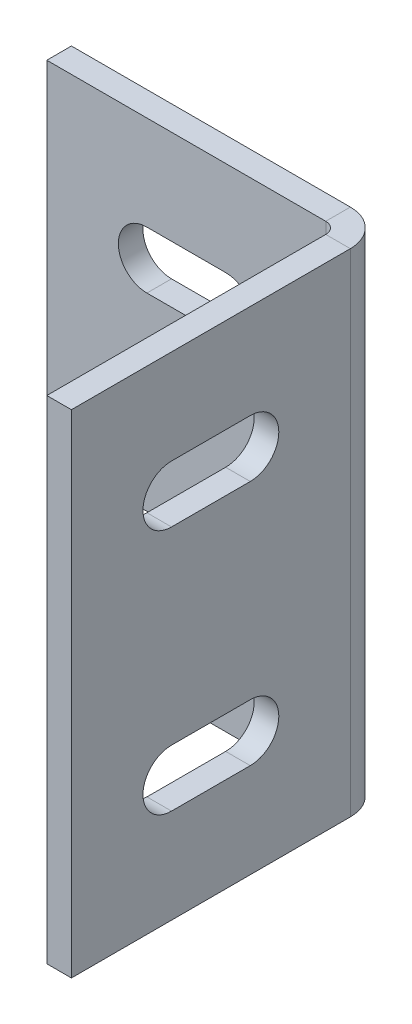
ISO-10303-21;
HEADER;
FILE_DESCRIPTION(('STEP AP214'),'2;1');
FILE_NAME('part.step','',(''),(''),'','','');
FILE_SCHEMA(('AUTOMOTIVE_DESIGN { 1 0 10303 214 1 1 1 1 }'));
ENDSEC;
DATA;
#1=APPLICATION_CONTEXT('core data for automotive mechanical design processes');
#2=APPLICATION_PROTOCOL_DEFINITION('international standard','automotive_design',2000,#1);
#3=PRODUCT_CONTEXT('',#1,'mechanical');
#4=PRODUCT('Part','Part','',(#3));
#5=PRODUCT_RELATED_PRODUCT_CATEGORY('part','',(#4));
#6=PRODUCT_DEFINITION_FORMATION('','',#4);
#7=PRODUCT_DEFINITION_CONTEXT('part definition',#1,'design');
#8=PRODUCT_DEFINITION('design','',#6,#7);
#9=PRODUCT_DEFINITION_SHAPE('','',#8);
#10=(LENGTH_UNIT() NAMED_UNIT(*) SI_UNIT(.MILLI.,.METRE.));
#11=(NAMED_UNIT(*) PLANE_ANGLE_UNIT() SI_UNIT($,.RADIAN.));
#12=(NAMED_UNIT(*) SI_UNIT($,.STERADIAN.) SOLID_ANGLE_UNIT());
#13=UNCERTAINTY_MEASURE_WITH_UNIT(LENGTH_MEASURE(1.E-05),#10,'distance_accuracy_value','');
#14=(GEOMETRIC_REPRESENTATION_CONTEXT(3) GLOBAL_UNCERTAINTY_ASSIGNED_CONTEXT((#13)) GLOBAL_UNIT_ASSIGNED_CONTEXT((#10,
#11,#12)) REPRESENTATION_CONTEXT('',''));
#15=CARTESIAN_POINT('',(0.,0.,0.));
#16=DIRECTION('',(0.,0.,1.));
#17=DIRECTION('',(1.,0.,0.));
#18=AXIS2_PLACEMENT_3D('',#15,#16,#17);
#19=CARTESIAN_POINT('',(-10.16,15.875,-1.5875));
#20=DIRECTION('',(0.,1.,0.));
#21=DIRECTION('',(0.,0.,1.));
#22=AXIS2_PLACEMENT_3D('',#19,#20,#21);
#23=PLANE('',#22);
#24=DIRECTION('',(-1.,0.,0.));
#25=VECTOR('',#24,1.);
#26=CARTESIAN_POINT('',(-10.16,15.875,0.));
#27=LINE('',#26,#25);
#28=CARTESIAN_POINT('',(7.8359,15.875,0.));
#29=VERTEX_POINT('',#28);
#30=CARTESIAN_POINT('',(-10.16,15.875,0.));
#31=VERTEX_POINT('',#30);
#32=EDGE_CURVE('E379',#29,#31,#27,.T.);
#33=ORIENTED_EDGE('',*,*,#32,.F.);
#34=DIRECTION('',(0.,0.,-1.));
#35=VECTOR('',#34,1.);
#36=CARTESIAN_POINT('',(7.8359,15.875,0.));
#37=LINE('',#36,#35);
#38=CARTESIAN_POINT('',(7.8359,15.875,-1.5875));
#39=VERTEX_POINT('',#38);
#40=EDGE_CURVE('E366',#29,#39,#37,.T.);
#41=ORIENTED_EDGE('',*,*,#40,.T.);
#42=DIRECTION('',(-1.,0.,0.));
#43=VECTOR('',#42,1.);
#44=CARTESIAN_POINT('',(-10.16,15.875,-1.5875));
#45=LINE('',#44,#43);
#46=CARTESIAN_POINT('',(-10.16,15.875,-1.5875));
#47=VERTEX_POINT('',#46);
#48=EDGE_CURVE('E382',#39,#47,#45,.T.);
#49=ORIENTED_EDGE('',*,*,#48,.T.);
#50=DIRECTION('',(0.,0.,1.));
#51=VECTOR('',#50,1.);
#52=CARTESIAN_POINT('',(-10.16,15.875,-1.5875));
#53=LINE('',#52,#51);
#54=EDGE_CURVE('E391',#47,#31,#53,.T.);
#55=ORIENTED_EDGE('',*,*,#54,.T.);
#56=EDGE_LOOP('',(#33,#41,#49,#55));
#57=FACE_BOUND('',#56,.T.);
#58=ADVANCED_FACE('F60',(#57),#23,.T.);
#59=CARTESIAN_POINT('',(0.,0.,-1.5875));
#60=DIRECTION('',(0.,0.,-1.));
#61=DIRECTION('',(-1.,0.,0.));
#62=AXIS2_PLACEMENT_3D('',#59,#60,#61);
#63=PLANE('',#62);
#64=CARTESIAN_POINT('',(-3.70205,7.9375,-1.5875));
#65=DIRECTION('',(0.,0.,-1.));
#66=DIRECTION('',(-1.,0.,0.));
#67=AXIS2_PLACEMENT_3D('',#64,#65,#66);
#68=CIRCLE('',#67,1.8415);
#69=CARTESIAN_POINT('',(-3.70205,6.096,-1.5875));
#70=VERTEX_POINT('',#69);
#71=CARTESIAN_POINT('',(-3.70205,9.779,-1.5875));
#72=VERTEX_POINT('',#71);
#73=EDGE_CURVE('E326',#70,#72,#68,.T.);
#74=ORIENTED_EDGE('',*,*,#73,.F.);
#75=DIRECTION('',(-1.,0.,0.));
#76=VECTOR('',#75,1.);
#77=CARTESIAN_POINT('',(0.,6.096,-1.5875));
#78=LINE('',#77,#76);
#79=CARTESIAN_POINT('',(1.37795,6.096,-1.5875));
#80=VERTEX_POINT('',#79);
#81=EDGE_CURVE('E319',#80,#70,#78,.T.);
#82=ORIENTED_EDGE('',*,*,#81,.F.);
#83=CARTESIAN_POINT('',(1.37795,7.9375,-1.5875));
#84=DIRECTION('',(0.,0.,-1.));
#85=DIRECTION('',(-1.,0.,0.));
#86=AXIS2_PLACEMENT_3D('',#83,#84,#85);
#87=CIRCLE('',#86,1.8415);
#88=CARTESIAN_POINT('',(1.37795,9.779,-1.5875));
#89=VERTEX_POINT('',#88);
#90=EDGE_CURVE('E321',#89,#80,#87,.T.);
#91=ORIENTED_EDGE('',*,*,#90,.F.);
#92=DIRECTION('',(1.,0.,0.));
#93=VECTOR('',#92,1.);
#94=CARTESIAN_POINT('',(0.,9.779,-1.5875));
#95=LINE('',#94,#93);
#96=EDGE_CURVE('E324',#72,#89,#95,.T.);
#97=ORIENTED_EDGE('',*,*,#96,.F.);
#98=EDGE_LOOP('',(#74,#82,#91,#97));
#99=FACE_BOUND('',#98,.T.);
#100=CARTESIAN_POINT('',(-3.70205,-7.9375,-1.5875));
#101=DIRECTION('',(0.,0.,-1.));
#102=DIRECTION('',(-1.,0.,0.));
#103=AXIS2_PLACEMENT_3D('',#100,#101,#102);
#104=CIRCLE('',#103,1.8415);
#105=CARTESIAN_POINT('',(-3.70205,-9.779,-1.5875));
#106=VERTEX_POINT('',#105);
#107=CARTESIAN_POINT('',(-3.70205,-6.096,-1.5875));
#108=VERTEX_POINT('',#107);
#109=EDGE_CURVE('E317',#106,#108,#104,.T.);
#110=ORIENTED_EDGE('',*,*,#109,.F.);
#111=DIRECTION('',(-1.,0.,0.));
#112=VECTOR('',#111,1.);
#113=CARTESIAN_POINT('',(0.,-9.779,-1.5875));
#114=LINE('',#113,#112);
#115=CARTESIAN_POINT('',(1.37795000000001,-9.779,-1.5875));
#116=VERTEX_POINT('',#115);
#117=EDGE_CURVE('E286',#116,#106,#114,.T.);
#118=ORIENTED_EDGE('',*,*,#117,.F.);
#119=CARTESIAN_POINT('',(1.37795,-7.9375,-1.5875));
#120=DIRECTION('',(0.,0.,-1.));
#121=DIRECTION('',(-1.,0.,0.));
#122=AXIS2_PLACEMENT_3D('',#119,#120,#121);
#123=CIRCLE('',#122,1.8415);
#124=CARTESIAN_POINT('',(1.37795,-6.096,-1.5875));
#125=VERTEX_POINT('',#124);
#126=EDGE_CURVE('E312',#125,#116,#123,.T.);
#127=ORIENTED_EDGE('',*,*,#126,.F.);
#128=DIRECTION('',(1.,0.,0.));
#129=VECTOR('',#128,1.);
#130=CARTESIAN_POINT('',(0.,-6.096,-1.5875));
#131=LINE('',#130,#129);
#132=EDGE_CURVE('E315',#108,#125,#131,.T.);
#133=ORIENTED_EDGE('',*,*,#132,.F.);
#134=EDGE_LOOP('',(#110,#118,#127,#133));
#135=FACE_BOUND('',#134,.T.);
#136=ORIENTED_EDGE('',*,*,#48,.F.);
#137=DIRECTION('',(0.,1.,0.));
#138=VECTOR('',#137,1.);
#139=CARTESIAN_POINT('',(7.8359,15.875,-1.5875));
#140=LINE('',#139,#138);
#141=CARTESIAN_POINT('',(7.8359,-15.875,-1.5875));
#142=VERTEX_POINT('',#141);
#143=EDGE_CURVE('E359',#39,#142,#140,.F.);
#144=ORIENTED_EDGE('',*,*,#143,.T.);
#145=DIRECTION('',(1.,0.,0.));
#146=VECTOR('',#145,1.);
#147=CARTESIAN_POINT('',(-10.16,-15.875,-1.5875));
#148=LINE('',#147,#146);
#149=CARTESIAN_POINT('',(-10.16,-15.875,-1.5875));
#150=VERTEX_POINT('',#149);
#151=EDGE_CURVE('E388',#150,#142,#148,.T.);
#152=ORIENTED_EDGE('',*,*,#151,.F.);
#153=DIRECTION('',(0.,-1.,0.));
#154=VECTOR('',#153,1.);
#155=CARTESIAN_POINT('',(-10.16,-15.875,-1.5875));
#156=LINE('',#155,#154);
#157=EDGE_CURVE('E384',#47,#150,#156,.T.);
#158=ORIENTED_EDGE('',*,*,#157,.F.);
#159=EDGE_LOOP('',(#136,#144,#152,#158));
#160=FACE_BOUND('',#159,.T.);
#161=ADVANCED_FACE('F436',(#99,#135,#160),#63,.T.);
#162=CARTESIAN_POINT('',(0.,0.,0.));
#163=DIRECTION('',(0.,0.,-1.));
#164=DIRECTION('',(-1.,0.,0.));
#165=AXIS2_PLACEMENT_3D('',#162,#163,#164);
#166=PLANE('',#165);
#167=DIRECTION('',(1.,0.,0.));
#168=VECTOR('',#167,1.);
#169=CARTESIAN_POINT('',(-3.70205,6.096,0.));
#170=LINE('',#169,#168);
#171=CARTESIAN_POINT('',(-3.70205,6.096,0.));
#172=VERTEX_POINT('',#171);
#173=CARTESIAN_POINT('',(1.37795,6.096,0.));
#174=VERTEX_POINT('',#173);
#175=EDGE_CURVE('E273',#172,#174,#170,.T.);
#176=ORIENTED_EDGE('',*,*,#175,.F.);
#177=CARTESIAN_POINT('',(-3.70205,7.9375,0.));
#178=DIRECTION('',(0.,0.,1.));
#179=DIRECTION('',(1.,0.,0.));
#180=AXIS2_PLACEMENT_3D('',#177,#178,#179);
#181=CIRCLE('',#180,1.8415);
#182=CARTESIAN_POINT('',(-3.70205,9.779,0.));
#183=VERTEX_POINT('',#182);
#184=EDGE_CURVE('E271',#183,#172,#181,.T.);
#185=ORIENTED_EDGE('',*,*,#184,.F.);
#186=DIRECTION('',(-1.,0.,0.));
#187=VECTOR('',#186,1.);
#188=CARTESIAN_POINT('',(-3.70205,9.779,0.));
#189=LINE('',#188,#187);
#190=CARTESIAN_POINT('',(1.37795,9.779,0.));
#191=VERTEX_POINT('',#190);
#192=EDGE_CURVE('E280',#191,#183,#189,.T.);
#193=ORIENTED_EDGE('',*,*,#192,.F.);
#194=CARTESIAN_POINT('',(1.37795,7.9375,0.));
#195=DIRECTION('',(0.,0.,1.));
#196=DIRECTION('',(1.,0.,0.));
#197=AXIS2_PLACEMENT_3D('',#194,#195,#196);
#198=CIRCLE('',#197,1.8415);
#199=EDGE_CURVE('E277',#174,#191,#198,.T.);
#200=ORIENTED_EDGE('',*,*,#199,.F.);
#201=EDGE_LOOP('',(#176,#185,#193,#200));
#202=FACE_BOUND('',#201,.T.);
#203=DIRECTION('',(1.,0.,0.));
#204=VECTOR('',#203,1.);
#205=CARTESIAN_POINT('',(-3.70205,-9.779,0.));
#206=LINE('',#205,#204);
#207=CARTESIAN_POINT('',(-3.70205,-9.779,0.));
#208=VERTEX_POINT('',#207);
#209=CARTESIAN_POINT('',(1.37795000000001,-9.779,0.));
#210=VERTEX_POINT('',#209);
#211=EDGE_CURVE('E294',#208,#210,#206,.T.);
#212=ORIENTED_EDGE('',*,*,#211,.F.);
#213=CARTESIAN_POINT('',(-3.70205,-7.9375,0.));
#214=DIRECTION('',(0.,0.,1.));
#215=DIRECTION('',(-1.,0.,0.));
#216=AXIS2_PLACEMENT_3D('',#213,#214,#215);
#217=CIRCLE('',#216,1.8415);
#218=CARTESIAN_POINT('',(-3.70205,-6.096,0.));
#219=VERTEX_POINT('',#218);
#220=EDGE_CURVE('E250',#219,#208,#217,.T.);
#221=ORIENTED_EDGE('',*,*,#220,.F.);
#222=DIRECTION('',(-1.,0.,0.));
#223=VECTOR('',#222,1.);
#224=CARTESIAN_POINT('',(-3.70205,-6.096,0.));
#225=LINE('',#224,#223);
#226=CARTESIAN_POINT('',(1.37795,-6.096,0.));
#227=VERTEX_POINT('',#226);
#228=EDGE_CURVE('E300',#227,#219,#225,.T.);
#229=ORIENTED_EDGE('',*,*,#228,.F.);
#230=CARTESIAN_POINT('',(1.37795,-7.9375,0.));
#231=DIRECTION('',(0.,0.,1.));
#232=DIRECTION('',(-1.,0.,0.));
#233=AXIS2_PLACEMENT_3D('',#230,#231,#232);
#234=CIRCLE('',#233,1.8415);
#235=EDGE_CURVE('E297',#210,#227,#234,.T.);
#236=ORIENTED_EDGE('',*,*,#235,.F.);
#237=EDGE_LOOP('',(#212,#221,#229,#236));
#238=FACE_BOUND('',#237,.T.);
#239=DIRECTION('',(0.,1.,0.));
#240=VECTOR('',#239,1.);
#241=CARTESIAN_POINT('',(7.8359,15.875,0.));
#242=LINE('',#241,#240);
#243=CARTESIAN_POINT('',(7.8359,-15.875,0.));
#244=VERTEX_POINT('',#243);
#245=EDGE_CURVE('E372',#29,#244,#242,.F.);
#246=ORIENTED_EDGE('',*,*,#245,.F.);
#247=ORIENTED_EDGE('',*,*,#32,.T.);
#248=DIRECTION('',(0.,-1.,0.));
#249=VECTOR('',#248,1.);
#250=CARTESIAN_POINT('',(-10.16,-15.875,0.));
#251=LINE('',#250,#249);
#252=CARTESIAN_POINT('',(-10.16,-15.875,0.));
#253=VERTEX_POINT('',#252);
#254=EDGE_CURVE('E393',#31,#253,#251,.T.);
#255=ORIENTED_EDGE('',*,*,#254,.T.);
#256=DIRECTION('',(1.,0.,0.));
#257=VECTOR('',#256,1.);
#258=CARTESIAN_POINT('',(-10.16,-15.875,0.));
#259=LINE('',#258,#257);
#260=EDGE_CURVE('E385',#253,#244,#259,.T.);
#261=ORIENTED_EDGE('',*,*,#260,.T.);
#262=EDGE_LOOP('',(#246,#247,#255,#261));
#263=FACE_BOUND('',#262,.T.);
#264=ADVANCED_FACE('F441',(#202,#238,#263),#166,.F.);
#265=CARTESIAN_POINT('',(-10.16,-15.875,-1.5875));
#266=DIRECTION('',(0.,-1.,0.));
#267=DIRECTION('',(0.,0.,-1.));
#268=AXIS2_PLACEMENT_3D('',#265,#266,#267);
#269=PLANE('',#268);
#270=DIRECTION('',(0.,0.,-1.));
#271=VECTOR('',#270,1.);
#272=CARTESIAN_POINT('',(7.8359,-15.875,0.));
#273=LINE('',#272,#271);
#274=EDGE_CURVE('E376',#244,#142,#273,.T.);
#275=ORIENTED_EDGE('',*,*,#274,.F.);
#276=ORIENTED_EDGE('',*,*,#260,.F.);
#277=DIRECTION('',(0.,0.,1.));
#278=VECTOR('',#277,1.);
#279=CARTESIAN_POINT('',(-10.16,-15.875,-1.5875));
#280=LINE('',#279,#278);
#281=EDGE_CURVE('E398',#150,#253,#280,.T.);
#282=ORIENTED_EDGE('',*,*,#281,.F.);
#283=ORIENTED_EDGE('',*,*,#151,.T.);
#284=EDGE_LOOP('',(#275,#276,#282,#283));
#285=FACE_BOUND('',#284,.T.);
#286=ADVANCED_FACE('F500',(#285),#269,.T.);
#287=CARTESIAN_POINT('',(-10.16,-15.875,-1.5875));
#288=DIRECTION('',(-1.,0.,0.));
#289=DIRECTION('',(0.,0.,1.));
#290=AXIS2_PLACEMENT_3D('',#287,#288,#289);
#291=PLANE('',#290);
#292=ORIENTED_EDGE('',*,*,#254,.F.);
#293=ORIENTED_EDGE('',*,*,#54,.F.);
#294=ORIENTED_EDGE('',*,*,#157,.T.);
#295=ORIENTED_EDGE('',*,*,#281,.T.);
#296=EDGE_LOOP('',(#292,#293,#294,#295));
#297=FACE_BOUND('',#296,.T.);
#298=ADVANCED_FACE('F495',(#297),#291,.T.);
#299=CARTESIAN_POINT('',(7.8359,-15.875,0.736599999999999));
#300=DIRECTION('',(0.,-1.,0.));
#301=DIRECTION('',(0.,0.,-1.));
#302=AXIS2_PLACEMENT_3D('',#299,#300,#301);
#303=PLANE('',#302);
#304=DIRECTION('',(-1.,0.,0.));
#305=VECTOR('',#304,1.);
#306=CARTESIAN_POINT('',(10.16,-15.875,0.736599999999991));
#307=LINE('',#306,#305);
#308=CARTESIAN_POINT('',(8.5725,-15.875,0.736599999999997));
#309=VERTEX_POINT('',#308);
#310=CARTESIAN_POINT('',(10.16,-15.875,0.736599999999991));
#311=VERTEX_POINT('',#310);
#312=EDGE_CURVE('E328',#309,#311,#307,.F.);
#313=ORIENTED_EDGE('',*,*,#312,.F.);
#314=CARTESIAN_POINT('',(7.8359,-15.875,0.736599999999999));
#315=DIRECTION('',(0.,1.,0.));
#316=DIRECTION('',(0.,0.,1.));
#317=AXIS2_PLACEMENT_3D('',#314,#315,#316);
#318=CIRCLE('',#317,0.7366);
#319=EDGE_CURVE('E369',#244,#309,#318,.F.);
#320=ORIENTED_EDGE('',*,*,#319,.F.);
#321=ORIENTED_EDGE('',*,*,#274,.T.);
#322=CARTESIAN_POINT('',(7.8359,-15.875,0.736599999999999));
#323=DIRECTION('',(0.,1.,0.));
#324=DIRECTION('',(0.,0.,1.));
#325=AXIS2_PLACEMENT_3D('',#322,#323,#324);
#326=CIRCLE('',#325,2.3241);
#327=EDGE_CURVE('E362',#142,#311,#326,.F.);
#328=ORIENTED_EDGE('',*,*,#327,.T.);
#329=EDGE_LOOP('',(#313,#320,#321,#328));
#330=FACE_BOUND('',#329,.T.);
#331=ADVANCED_FACE('F458',(#330),#303,.T.);
#332=CARTESIAN_POINT('',(7.8359,15.875,0.736600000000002));
#333=DIRECTION('',(0.,-1.,0.));
#334=DIRECTION('',(0.,0.,-1.));
#335=AXIS2_PLACEMENT_3D('',#332,#333,#334);
#336=PLANE('',#335);
#337=CARTESIAN_POINT('',(7.8359,15.875,0.736600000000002));
#338=DIRECTION('',(0.,1.,0.));
#339=DIRECTION('',(0.,0.,1.));
#340=AXIS2_PLACEMENT_3D('',#337,#338,#339);
#341=CIRCLE('',#340,0.7366);
#342=CARTESIAN_POINT('',(8.5725,15.875,0.736599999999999));
#343=VERTEX_POINT('',#342);
#344=EDGE_CURVE('E332',#343,#29,#341,.T.);
#345=ORIENTED_EDGE('',*,*,#344,.F.);
#346=DIRECTION('',(-1.,0.,0.));
#347=VECTOR('',#346,1.);
#348=CARTESIAN_POINT('',(8.5725,15.875,0.736599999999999));
#349=LINE('',#348,#347);
#350=CARTESIAN_POINT('',(10.16,15.875,0.736599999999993));
#351=VERTEX_POINT('',#350);
#352=EDGE_CURVE('E352',#343,#351,#349,.F.);
#353=ORIENTED_EDGE('',*,*,#352,.T.);
#354=CARTESIAN_POINT('',(7.8359,15.875,0.736600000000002));
#355=DIRECTION('',(0.,1.,0.));
#356=DIRECTION('',(0.,0.,1.));
#357=AXIS2_PLACEMENT_3D('',#354,#355,#356);
#358=CIRCLE('',#357,2.3241);
#359=EDGE_CURVE('E363',#351,#39,#358,.T.);
#360=ORIENTED_EDGE('',*,*,#359,.T.);
#361=ORIENTED_EDGE('',*,*,#40,.F.);
#362=EDGE_LOOP('',(#345,#353,#360,#361));
#363=FACE_BOUND('',#362,.T.);
#364=ADVANCED_FACE('F476',(#363),#336,.F.);
#365=CARTESIAN_POINT('',(7.8359,15.875,0.736600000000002));
#366=DIRECTION('',(0.,1.,0.));
#367=DIRECTION('',(1.,0.,0.));
#368=AXIS2_PLACEMENT_3D('',#365,#366,#367);
#369=CYLINDRICAL_SURFACE('',#368,2.3241);
#370=ORIENTED_EDGE('',*,*,#143,.F.);
#371=ORIENTED_EDGE('',*,*,#359,.F.);
#372=DIRECTION('',(0.,1.,0.));
#373=VECTOR('',#372,1.);
#374=CARTESIAN_POINT('',(10.16,-15.875,0.736599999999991));
#375=LINE('',#374,#373);
#376=EDGE_CURVE('E350',#351,#311,#375,.F.);
#377=ORIENTED_EDGE('',*,*,#376,.T.);
#378=ORIENTED_EDGE('',*,*,#327,.F.);
#379=EDGE_LOOP('',(#370,#371,#377,#378));
#380=FACE_BOUND('',#379,.T.);
#381=ADVANCED_FACE('F486',(#380),#369,.T.);
#382=CARTESIAN_POINT('',(7.8359,15.875,0.736600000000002));
#383=DIRECTION('',(0.,1.,0.));
#384=DIRECTION('',(1.,0.,0.));
#385=AXIS2_PLACEMENT_3D('',#382,#383,#384);
#386=CYLINDRICAL_SURFACE('',#385,0.7366);
#387=ORIENTED_EDGE('',*,*,#245,.T.);
#388=ORIENTED_EDGE('',*,*,#319,.T.);
#389=DIRECTION('',(0.,1.,0.));
#390=VECTOR('',#389,1.);
#391=CARTESIAN_POINT('',(8.5725,-15.875,0.736599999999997));
#392=LINE('',#391,#390);
#393=EDGE_CURVE('E355',#309,#343,#392,.T.);
#394=ORIENTED_EDGE('',*,*,#393,.T.);
#395=ORIENTED_EDGE('',*,*,#344,.T.);
#396=EDGE_LOOP('',(#387,#388,#394,#395));
#397=FACE_BOUND('',#396,.T.);
#398=ADVANCED_FACE('F454',(#397),#386,.F.);
#399=CARTESIAN_POINT('',(10.1600000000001,15.875,18.7325));
#400=DIRECTION('',(0.,-1.,0.));
#401=DIRECTION('',(0.,0.,-1.));
#402=AXIS2_PLACEMENT_3D('',#399,#400,#401);
#403=PLANE('',#402);
#404=ORIENTED_EDGE('',*,*,#352,.F.);
#405=DIRECTION('',(0.,0.,-1.));
#406=VECTOR('',#405,1.);
#407=CARTESIAN_POINT('',(8.57250000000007,15.875,18.7325));
#408=LINE('',#407,#406);
#409=CARTESIAN_POINT('',(8.57250000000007,15.875,18.7325));
#410=VERTEX_POINT('',#409);
#411=EDGE_CURVE('E348',#343,#410,#408,.F.);
#412=ORIENTED_EDGE('',*,*,#411,.T.);
#413=DIRECTION('',(-1.,0.,0.));
#414=VECTOR('',#413,1.);
#415=CARTESIAN_POINT('',(10.1600000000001,15.875,18.7325));
#416=LINE('',#415,#414);
#417=CARTESIAN_POINT('',(10.1600000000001,15.875,18.7325));
#418=VERTEX_POINT('',#417);
#419=EDGE_CURVE('E329',#418,#410,#416,.T.);
#420=ORIENTED_EDGE('',*,*,#419,.F.);
#421=DIRECTION('',(0.,0.,1.));
#422=VECTOR('',#421,1.);
#423=CARTESIAN_POINT('',(10.16,15.875,0.));
#424=LINE('',#423,#422);
#425=EDGE_CURVE('E341',#351,#418,#424,.T.);
#426=ORIENTED_EDGE('',*,*,#425,.F.);
#427=EDGE_LOOP('',(#404,#412,#420,#426));
#428=FACE_BOUND('',#427,.T.);
#429=ADVANCED_FACE('F478',(#428),#403,.F.);
#430=CARTESIAN_POINT('',(10.16,-15.875,0.));
#431=DIRECTION('',(0.,1.,0.));
#432=DIRECTION('',(0.,0.,1.));
#433=AXIS2_PLACEMENT_3D('',#430,#431,#432);
#434=PLANE('',#433);
#435=ORIENTED_EDGE('',*,*,#312,.T.);
#436=DIRECTION('',(0.,0.,-1.));
#437=VECTOR('',#436,1.);
#438=CARTESIAN_POINT('',(10.16,-15.875,0.));
#439=LINE('',#438,#437);
#440=CARTESIAN_POINT('',(10.1600000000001,-15.875,18.7325));
#441=VERTEX_POINT('',#440);
#442=EDGE_CURVE('E336',#441,#311,#439,.T.);
#443=ORIENTED_EDGE('',*,*,#442,.F.);
#444=DIRECTION('',(-1.,0.,0.));
#445=VECTOR('',#444,1.);
#446=CARTESIAN_POINT('',(10.1600000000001,-15.875,18.7325));
#447=LINE('',#446,#445);
#448=CARTESIAN_POINT('',(8.57250000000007,-15.875,18.7325));
#449=VERTEX_POINT('',#448);
#450=EDGE_CURVE('E333',#441,#449,#447,.T.);
#451=ORIENTED_EDGE('',*,*,#450,.T.);
#452=DIRECTION('',(0.,0.,1.));
#453=VECTOR('',#452,1.);
#454=CARTESIAN_POINT('',(8.5725,-15.875,0.));
#455=LINE('',#454,#453);
#456=EDGE_CURVE('E343',#449,#309,#455,.F.);
#457=ORIENTED_EDGE('',*,*,#456,.T.);
#458=EDGE_LOOP('',(#435,#443,#451,#457));
#459=FACE_BOUND('',#458,.T.);
#460=ADVANCED_FACE('F461',(#459),#434,.F.);
#461=CARTESIAN_POINT('',(10.16,0.,0.));
#462=DIRECTION('',(-1.,0.,0.));
#463=DIRECTION('',(0.,0.,1.));
#464=AXIS2_PLACEMENT_3D('',#461,#462,#463);
#465=PLANE('',#464);
#466=DIRECTION('',(0.,0.,-1.));
#467=VECTOR('',#466,1.);
#468=CARTESIAN_POINT('',(10.16,6.096,12.27455));
#469=LINE('',#468,#467);
#470=CARTESIAN_POINT('',(10.16,6.096,12.2745500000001));
#471=VERTEX_POINT('',#470);
#472=CARTESIAN_POINT('',(10.16,6.096,7.19455));
#473=VERTEX_POINT('',#472);
#474=EDGE_CURVE('E236',#471,#473,#469,.T.);
#475=ORIENTED_EDGE('',*,*,#474,.F.);
#476=CARTESIAN_POINT('',(10.16,7.9375,12.27455));
#477=DIRECTION('',(1.,0.,0.));
#478=DIRECTION('',(0.,0.,-1.));
#479=AXIS2_PLACEMENT_3D('',#476,#477,#478);
#480=CIRCLE('',#479,1.8415);
#481=CARTESIAN_POINT('',(10.16,9.779,12.27455));
#482=VERTEX_POINT('',#481);
#483=EDGE_CURVE('E74',#482,#471,#480,.T.);
#484=ORIENTED_EDGE('',*,*,#483,.F.);
#485=DIRECTION('',(0.,0.,1.));
#486=VECTOR('',#485,1.);
#487=CARTESIAN_POINT('',(10.16,9.779,12.27455));
#488=LINE('',#487,#486);
#489=CARTESIAN_POINT('',(10.16,9.779,7.19455));
#490=VERTEX_POINT('',#489);
#491=EDGE_CURVE('E243',#490,#482,#488,.T.);
#492=ORIENTED_EDGE('',*,*,#491,.F.);
#493=CARTESIAN_POINT('',(10.16,7.9375,7.19455));
#494=DIRECTION('',(1.,0.,0.));
#495=DIRECTION('',(0.,0.,-1.));
#496=AXIS2_PLACEMENT_3D('',#493,#494,#495);
#497=CIRCLE('',#496,1.8415);
#498=EDGE_CURVE('E226',#473,#490,#497,.T.);
#499=ORIENTED_EDGE('',*,*,#498,.F.);
#500=EDGE_LOOP('',(#475,#484,#492,#499));
#501=FACE_BOUND('',#500,.T.);
#502=DIRECTION('',(0.,0.,-1.));
#503=VECTOR('',#502,1.);
#504=CARTESIAN_POINT('',(10.16,-9.779,12.27455));
#505=LINE('',#504,#503);
#506=CARTESIAN_POINT('',(10.16,-9.779,12.2745500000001));
#507=VERTEX_POINT('',#506);
#508=CARTESIAN_POINT('',(10.16,-9.779,7.19455));
#509=VERTEX_POINT('',#508);
#510=EDGE_CURVE('E254',#507,#509,#505,.T.);
#511=ORIENTED_EDGE('',*,*,#510,.F.);
#512=CARTESIAN_POINT('',(10.16,-7.9375,12.27455));
#513=DIRECTION('',(1.,0.,0.));
#514=DIRECTION('',(0.,0.,1.));
#515=AXIS2_PLACEMENT_3D('',#512,#513,#514);
#516=CIRCLE('',#515,1.8415);
#517=CARTESIAN_POINT('',(10.16,-6.096,12.27455));
#518=VERTEX_POINT('',#517);
#519=EDGE_CURVE('E82',#518,#507,#516,.T.);
#520=ORIENTED_EDGE('',*,*,#519,.F.);
#521=DIRECTION('',(0.,0.,1.));
#522=VECTOR('',#521,1.);
#523=CARTESIAN_POINT('',(10.16,-6.096,12.27455));
#524=LINE('',#523,#522);
#525=CARTESIAN_POINT('',(10.16,-6.096,7.19455));
#526=VERTEX_POINT('',#525);
#527=EDGE_CURVE('E260',#526,#518,#524,.T.);
#528=ORIENTED_EDGE('',*,*,#527,.F.);
#529=CARTESIAN_POINT('',(10.16,-7.9375,7.19455));
#530=DIRECTION('',(1.,0.,0.));
#531=DIRECTION('',(0.,0.,1.));
#532=AXIS2_PLACEMENT_3D('',#529,#530,#531);
#533=CIRCLE('',#532,1.8415);
#534=EDGE_CURVE('E257',#509,#526,#533,.T.);
#535=ORIENTED_EDGE('',*,*,#534,.F.);
#536=EDGE_LOOP('',(#511,#520,#528,#535));
#537=FACE_BOUND('',#536,.T.);
#538=ORIENTED_EDGE('',*,*,#376,.F.);
#539=ORIENTED_EDGE('',*,*,#425,.T.);
#540=DIRECTION('',(0.,-1.,0.));
#541=VECTOR('',#540,1.);
#542=CARTESIAN_POINT('',(10.1600000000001,0.,18.7325));
#543=LINE('',#542,#541);
#544=EDGE_CURVE('E339',#418,#441,#543,.T.);
#545=ORIENTED_EDGE('',*,*,#544,.T.);
#546=ORIENTED_EDGE('',*,*,#442,.T.);
#547=EDGE_LOOP('',(#538,#539,#545,#546));
#548=FACE_BOUND('',#547,.T.);
#549=ADVANCED_FACE('F240',(#501,#537,#548),#465,.F.);
#550=CARTESIAN_POINT('',(8.5725,0.,0.));
#551=DIRECTION('',(-1.,0.,0.));
#552=DIRECTION('',(0.,0.,1.));
#553=AXIS2_PLACEMENT_3D('',#550,#551,#552);
#554=PLANE('',#553);
#555=CARTESIAN_POINT('',(8.57250000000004,7.9375,12.27455));
#556=DIRECTION('',(-1.,0.,0.));
#557=DIRECTION('',(0.,0.,1.));
#558=AXIS2_PLACEMENT_3D('',#555,#556,#557);
#559=CIRCLE('',#558,1.8415);
#560=CARTESIAN_POINT('',(8.57250000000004,6.096,12.27455));
#561=VERTEX_POINT('',#560);
#562=CARTESIAN_POINT('',(8.57250000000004,9.779,12.27455));
#563=VERTEX_POINT('',#562);
#564=EDGE_CURVE('E13',#561,#563,#559,.T.);
#565=ORIENTED_EDGE('',*,*,#564,.F.);
#566=DIRECTION('',(0.,0.,1.));
#567=VECTOR('',#566,1.);
#568=CARTESIAN_POINT('',(8.5725,6.096,0.));
#569=LINE('',#568,#567);
#570=CARTESIAN_POINT('',(8.57250000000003,6.096,7.19455));
#571=VERTEX_POINT('',#570);
#572=EDGE_CURVE('E411',#571,#561,#569,.T.);
#573=ORIENTED_EDGE('',*,*,#572,.F.);
#574=CARTESIAN_POINT('',(8.57250000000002,7.9375,7.19455));
#575=DIRECTION('',(-1.,0.,0.));
#576=DIRECTION('',(0.,0.,1.));
#577=AXIS2_PLACEMENT_3D('',#574,#575,#576);
#578=CIRCLE('',#577,1.8415);
#579=CARTESIAN_POINT('',(8.57250000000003,9.779,7.19455));
#580=VERTEX_POINT('',#579);
#581=EDGE_CURVE('E229',#580,#571,#578,.T.);
#582=ORIENTED_EDGE('',*,*,#581,.F.);
#583=DIRECTION('',(0.,0.,-1.));
#584=VECTOR('',#583,1.);
#585=CARTESIAN_POINT('',(8.5725,9.77900000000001,0.));
#586=LINE('',#585,#584);
#587=EDGE_CURVE('E67',#563,#580,#586,.T.);
#588=ORIENTED_EDGE('',*,*,#587,.F.);
#589=EDGE_LOOP('',(#565,#573,#582,#588));
#590=FACE_BOUND('',#589,.T.);
#591=CARTESIAN_POINT('',(8.57250000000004,-7.9375,12.27455));
#592=DIRECTION('',(-1.,0.,0.));
#593=DIRECTION('',(0.,0.,1.));
#594=AXIS2_PLACEMENT_3D('',#591,#592,#593);
#595=CIRCLE('',#594,1.8415);
#596=CARTESIAN_POINT('',(8.57250000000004,-9.779,12.27455));
#597=VERTEX_POINT('',#596);
#598=CARTESIAN_POINT('',(8.57250000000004,-6.096,12.27455));
#599=VERTEX_POINT('',#598);
#600=EDGE_CURVE('E409',#597,#599,#595,.T.);
#601=ORIENTED_EDGE('',*,*,#600,.F.);
#602=DIRECTION('',(0.,0.,1.));
#603=VECTOR('',#602,1.);
#604=CARTESIAN_POINT('',(8.5725,-9.779,0.));
#605=LINE('',#604,#603);
#606=CARTESIAN_POINT('',(8.57250000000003,-9.779,7.19455));
#607=VERTEX_POINT('',#606);
#608=EDGE_CURVE('E400',#607,#597,#605,.T.);
#609=ORIENTED_EDGE('',*,*,#608,.F.);
#610=CARTESIAN_POINT('',(8.57250000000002,-7.9375,7.19455));
#611=DIRECTION('',(-1.,0.,0.));
#612=DIRECTION('',(0.,0.,1.));
#613=AXIS2_PLACEMENT_3D('',#610,#611,#612);
#614=CIRCLE('',#613,1.8415);
#615=CARTESIAN_POINT('',(8.57250000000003,-6.096,7.19455));
#616=VERTEX_POINT('',#615);
#617=EDGE_CURVE('E404',#616,#607,#614,.T.);
#618=ORIENTED_EDGE('',*,*,#617,.F.);
#619=DIRECTION('',(0.,0.,-1.));
#620=VECTOR('',#619,1.);
#621=CARTESIAN_POINT('',(8.5725,-6.096,0.));
#622=LINE('',#621,#620);
#623=EDGE_CURVE('E407',#599,#616,#622,.T.);
#624=ORIENTED_EDGE('',*,*,#623,.F.);
#625=EDGE_LOOP('',(#601,#609,#618,#624));
#626=FACE_BOUND('',#625,.T.);
#627=ORIENTED_EDGE('',*,*,#411,.F.);
#628=ORIENTED_EDGE('',*,*,#393,.F.);
#629=ORIENTED_EDGE('',*,*,#456,.F.);
#630=DIRECTION('',(0.,1.,0.));
#631=VECTOR('',#630,1.);
#632=CARTESIAN_POINT('',(8.57250000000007,-15.875,18.7325));
#633=LINE('',#632,#631);
#634=EDGE_CURVE('E346',#410,#449,#633,.F.);
#635=ORIENTED_EDGE('',*,*,#634,.F.);
#636=EDGE_LOOP('',(#627,#628,#629,#635));
#637=FACE_BOUND('',#636,.T.);
#638=ADVANCED_FACE('F419',(#590,#626,#637),#554,.T.);
#639=CARTESIAN_POINT('',(10.1600000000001,-15.875,18.7325));
#640=DIRECTION('',(0.,0.,-1.));
#641=DIRECTION('',(-1.,0.,0.));
#642=AXIS2_PLACEMENT_3D('',#639,#640,#641);
#643=PLANE('',#642);
#644=ORIENTED_EDGE('',*,*,#634,.T.);
#645=ORIENTED_EDGE('',*,*,#450,.F.);
#646=ORIENTED_EDGE('',*,*,#544,.F.);
#647=ORIENTED_EDGE('',*,*,#419,.T.);
#648=EDGE_LOOP('',(#644,#645,#646,#647));
#649=FACE_BOUND('',#648,.T.);
#650=ADVANCED_FACE('F470',(#649),#643,.F.);
#651=CARTESIAN_POINT('',(-3.70205,-7.9375,-2.54));
#652=DIRECTION('',(0.,0.,1.));
#653=DIRECTION('',(1.,0.,0.));
#654=AXIS2_PLACEMENT_3D('',#651,#652,#653);
#655=CYLINDRICAL_SURFACE('',#654,1.8415);
#656=ORIENTED_EDGE('',*,*,#109,.T.);
#657=DIRECTION('',(0.,0.,1.));
#658=VECTOR('',#657,1.);
#659=CARTESIAN_POINT('',(-3.70205,-6.096,-2.54));
#660=LINE('',#659,#658);
#661=EDGE_CURVE('E274',#108,#219,#660,.T.);
#662=ORIENTED_EDGE('',*,*,#661,.T.);
#663=ORIENTED_EDGE('',*,*,#220,.T.);
#664=DIRECTION('',(0.,0.,1.));
#665=VECTOR('',#664,1.);
#666=CARTESIAN_POINT('',(-3.70205,-9.779,-2.54));
#667=LINE('',#666,#665);
#668=EDGE_CURVE('E303',#106,#208,#667,.T.);
#669=ORIENTED_EDGE('',*,*,#668,.F.);
#670=EDGE_LOOP('',(#656,#662,#663,#669));
#671=FACE_BOUND('',#670,.T.);
#672=ADVANCED_FACE('F553',(#671),#655,.F.);
#673=CARTESIAN_POINT('',(-3.70205,-6.096,-2.54));
#674=DIRECTION('',(0.,1.,0.));
#675=DIRECTION('',(-1.,0.,0.));
#676=AXIS2_PLACEMENT_3D('',#673,#674,#675);
#677=PLANE('',#676);
#678=ORIENTED_EDGE('',*,*,#132,.T.);
#679=DIRECTION('',(0.,0.,1.));
#680=VECTOR('',#679,1.);
#681=CARTESIAN_POINT('',(1.37795,-6.096,-2.54));
#682=LINE('',#681,#680);
#683=EDGE_CURVE('E305',#125,#227,#682,.T.);
#684=ORIENTED_EDGE('',*,*,#683,.T.);
#685=ORIENTED_EDGE('',*,*,#228,.T.);
#686=ORIENTED_EDGE('',*,*,#661,.F.);
#687=EDGE_LOOP('',(#678,#684,#685,#686));
#688=FACE_BOUND('',#687,.T.);
#689=ADVANCED_FACE('F578',(#688),#677,.F.);
#690=CARTESIAN_POINT('',(1.37795,-7.9375,-2.54));
#691=DIRECTION('',(0.,0.,1.));
#692=DIRECTION('',(1.,0.,0.));
#693=AXIS2_PLACEMENT_3D('',#690,#691,#692);
#694=CYLINDRICAL_SURFACE('',#693,1.8415);
#695=ORIENTED_EDGE('',*,*,#126,.T.);
#696=DIRECTION('',(0.,0.,1.));
#697=VECTOR('',#696,1.);
#698=CARTESIAN_POINT('',(1.37795000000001,-9.779,-2.54));
#699=LINE('',#698,#697);
#700=EDGE_CURVE('E307',#116,#210,#699,.T.);
#701=ORIENTED_EDGE('',*,*,#700,.T.);
#702=ORIENTED_EDGE('',*,*,#235,.T.);
#703=ORIENTED_EDGE('',*,*,#683,.F.);
#704=EDGE_LOOP('',(#695,#701,#702,#703));
#705=FACE_BOUND('',#704,.T.);
#706=ADVANCED_FACE('F589',(#705),#694,.F.);
#707=CARTESIAN_POINT('',(-3.70205,-9.779,-2.54));
#708=DIRECTION('',(0.,-1.,0.));
#709=DIRECTION('',(0.,0.,-1.));
#710=AXIS2_PLACEMENT_3D('',#707,#708,#709);
#711=PLANE('',#710);
#712=ORIENTED_EDGE('',*,*,#117,.T.);
#713=ORIENTED_EDGE('',*,*,#668,.T.);
#714=ORIENTED_EDGE('',*,*,#211,.T.);
#715=ORIENTED_EDGE('',*,*,#700,.F.);
#716=EDGE_LOOP('',(#712,#713,#714,#715));
#717=FACE_BOUND('',#716,.T.);
#718=ADVANCED_FACE('F600',(#717),#711,.F.);
#719=CARTESIAN_POINT('',(-3.70205,7.9375,-2.54));
#720=DIRECTION('',(0.,0.,1.));
#721=DIRECTION('',(1.,0.,0.));
#722=AXIS2_PLACEMENT_3D('',#719,#720,#721);
#723=CYLINDRICAL_SURFACE('',#722,1.8415);
#724=ORIENTED_EDGE('',*,*,#73,.T.);
#725=DIRECTION('',(0.,0.,1.));
#726=VECTOR('',#725,1.);
#727=CARTESIAN_POINT('',(-3.70205,9.779,-2.54));
#728=LINE('',#727,#726);
#729=EDGE_CURVE('E284',#72,#183,#728,.T.);
#730=ORIENTED_EDGE('',*,*,#729,.T.);
#731=ORIENTED_EDGE('',*,*,#184,.T.);
#732=DIRECTION('',(0.,0.,1.));
#733=VECTOR('',#732,1.);
#734=CARTESIAN_POINT('',(-3.70205,6.096,-2.54));
#735=LINE('',#734,#733);
#736=EDGE_CURVE('E283',#70,#172,#735,.T.);
#737=ORIENTED_EDGE('',*,*,#736,.F.);
#738=EDGE_LOOP('',(#724,#730,#731,#737));
#739=FACE_BOUND('',#738,.T.);
#740=ADVANCED_FACE('F611',(#739),#723,.F.);
#741=CARTESIAN_POINT('',(-3.70205,9.779,-2.54));
#742=DIRECTION('',(0.,1.,0.));
#743=DIRECTION('',(0.,0.,1.));
#744=AXIS2_PLACEMENT_3D('',#741,#742,#743);
#745=PLANE('',#744);
#746=ORIENTED_EDGE('',*,*,#96,.T.);
#747=DIRECTION('',(0.,0.,1.));
#748=VECTOR('',#747,1.);
#749=CARTESIAN_POINT('',(1.37795,9.779,-2.54));
#750=LINE('',#749,#748);
#751=EDGE_CURVE('E287',#89,#191,#750,.T.);
#752=ORIENTED_EDGE('',*,*,#751,.T.);
#753=ORIENTED_EDGE('',*,*,#192,.T.);
#754=ORIENTED_EDGE('',*,*,#729,.F.);
#755=EDGE_LOOP('',(#746,#752,#753,#754));
#756=FACE_BOUND('',#755,.T.);
#757=ADVANCED_FACE('F622',(#756),#745,.F.);
#758=CARTESIAN_POINT('',(1.37795,7.9375,-2.54));
#759=DIRECTION('',(0.,0.,1.));
#760=DIRECTION('',(1.,0.,0.));
#761=AXIS2_PLACEMENT_3D('',#758,#759,#760);
#762=CYLINDRICAL_SURFACE('',#761,1.8415);
#763=ORIENTED_EDGE('',*,*,#90,.T.);
#764=DIRECTION('',(0.,0.,1.));
#765=VECTOR('',#764,1.);
#766=CARTESIAN_POINT('',(1.37795,6.096,-2.54));
#767=LINE('',#766,#765);
#768=EDGE_CURVE('E289',#80,#174,#767,.T.);
#769=ORIENTED_EDGE('',*,*,#768,.T.);
#770=ORIENTED_EDGE('',*,*,#199,.T.);
#771=ORIENTED_EDGE('',*,*,#751,.F.);
#772=EDGE_LOOP('',(#763,#769,#770,#771));
#773=FACE_BOUND('',#772,.T.);
#774=ADVANCED_FACE('F633',(#773),#762,.F.);
#775=CARTESIAN_POINT('',(-3.70205,6.096,-2.54));
#776=DIRECTION('',(0.,-1.,0.));
#777=DIRECTION('',(1.,0.,0.));
#778=AXIS2_PLACEMENT_3D('',#775,#776,#777);
#779=PLANE('',#778);
#780=ORIENTED_EDGE('',*,*,#81,.T.);
#781=ORIENTED_EDGE('',*,*,#736,.T.);
#782=ORIENTED_EDGE('',*,*,#175,.T.);
#783=ORIENTED_EDGE('',*,*,#768,.F.);
#784=EDGE_LOOP('',(#780,#781,#782,#783));
#785=FACE_BOUND('',#784,.T.);
#786=ADVANCED_FACE('F644',(#785),#779,.F.);
#787=CARTESIAN_POINT('',(-10.16,-7.9375,12.2745500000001));
#788=DIRECTION('',(1.,0.,0.));
#789=DIRECTION('',(0.,0.,-1.));
#790=AXIS2_PLACEMENT_3D('',#787,#788,#789);
#791=CYLINDRICAL_SURFACE('',#790,1.8415);
#792=ORIENTED_EDGE('',*,*,#600,.T.);
#793=DIRECTION('',(1.,0.,0.));
#794=VECTOR('',#793,1.);
#795=CARTESIAN_POINT('',(-10.16,-6.096,12.2745500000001));
#796=LINE('',#795,#794);
#797=EDGE_CURVE('E264',#599,#518,#796,.T.);
#798=ORIENTED_EDGE('',*,*,#797,.T.);
#799=ORIENTED_EDGE('',*,*,#519,.T.);
#800=DIRECTION('',(1.,0.,0.));
#801=VECTOR('',#800,1.);
#802=CARTESIAN_POINT('',(-10.16,-9.779,12.2745500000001));
#803=LINE('',#802,#801);
#804=EDGE_CURVE('E263',#597,#507,#803,.T.);
#805=ORIENTED_EDGE('',*,*,#804,.F.);
#806=EDGE_LOOP('',(#792,#798,#799,#805));
#807=FACE_BOUND('',#806,.T.);
#808=ADVANCED_FACE('F655',(#807),#791,.F.);
#809=CARTESIAN_POINT('',(-10.16,-6.096,12.2745500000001));
#810=DIRECTION('',(0.,1.,0.));
#811=DIRECTION('',(0.,0.,1.));
#812=AXIS2_PLACEMENT_3D('',#809,#810,#811);
#813=PLANE('',#812);
#814=ORIENTED_EDGE('',*,*,#623,.T.);
#815=DIRECTION('',(1.,0.,0.));
#816=VECTOR('',#815,1.);
#817=CARTESIAN_POINT('',(-10.16,-6.096,7.19455000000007));
#818=LINE('',#817,#816);
#819=EDGE_CURVE('E266',#616,#526,#818,.T.);
#820=ORIENTED_EDGE('',*,*,#819,.T.);
#821=ORIENTED_EDGE('',*,*,#527,.T.);
#822=ORIENTED_EDGE('',*,*,#797,.F.);
#823=EDGE_LOOP('',(#814,#820,#821,#822));
#824=FACE_BOUND('',#823,.T.);
#825=ADVANCED_FACE('F680',(#824),#813,.F.);
#826=CARTESIAN_POINT('',(-10.16,-7.9375,7.19455000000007));
#827=DIRECTION('',(1.,0.,0.));
#828=DIRECTION('',(0.,0.,-1.));
#829=AXIS2_PLACEMENT_3D('',#826,#827,#828);
#830=CYLINDRICAL_SURFACE('',#829,1.8415);
#831=ORIENTED_EDGE('',*,*,#617,.T.);
#832=DIRECTION('',(1.,0.,0.));
#833=VECTOR('',#832,1.);
#834=CARTESIAN_POINT('',(-10.16,-9.779,7.19455000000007));
#835=LINE('',#834,#833);
#836=EDGE_CURVE('E268',#607,#509,#835,.T.);
#837=ORIENTED_EDGE('',*,*,#836,.T.);
#838=ORIENTED_EDGE('',*,*,#534,.T.);
#839=ORIENTED_EDGE('',*,*,#819,.F.);
#840=EDGE_LOOP('',(#831,#837,#838,#839));
#841=FACE_BOUND('',#840,.T.);
#842=ADVANCED_FACE('F430',(#841),#830,.F.);
#843=CARTESIAN_POINT('',(-10.16,-9.779,12.2745500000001));
#844=DIRECTION('',(0.,-1.,0.));
#845=DIRECTION('',(0.,0.,-1.));
#846=AXIS2_PLACEMENT_3D('',#843,#844,#845);
#847=PLANE('',#846);
#848=ORIENTED_EDGE('',*,*,#608,.T.);
#849=ORIENTED_EDGE('',*,*,#804,.T.);
#850=ORIENTED_EDGE('',*,*,#510,.T.);
#851=ORIENTED_EDGE('',*,*,#836,.F.);
#852=EDGE_LOOP('',(#848,#849,#850,#851));
#853=FACE_BOUND('',#852,.T.);
#854=ADVANCED_FACE('F423',(#853),#847,.F.);
#855=CARTESIAN_POINT('',(-10.16,7.9375,12.2745500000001));
#856=DIRECTION('',(1.,0.,0.));
#857=DIRECTION('',(0.,0.,-1.));
#858=AXIS2_PLACEMENT_3D('',#855,#856,#857);
#859=CYLINDRICAL_SURFACE('',#858,1.8415);
#860=ORIENTED_EDGE('',*,*,#564,.T.);
#861=DIRECTION('',(1.,0.,0.));
#862=VECTOR('',#861,1.);
#863=CARTESIAN_POINT('',(-10.16,9.779,12.2745500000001));
#864=LINE('',#863,#862);
#865=EDGE_CURVE('E248',#563,#482,#864,.T.);
#866=ORIENTED_EDGE('',*,*,#865,.T.);
#867=ORIENTED_EDGE('',*,*,#483,.T.);
#868=DIRECTION('',(1.,0.,0.));
#869=VECTOR('',#868,1.);
#870=CARTESIAN_POINT('',(-10.16,6.096,12.2745500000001));
#871=LINE('',#870,#869);
#872=EDGE_CURVE('E233',#561,#471,#871,.T.);
#873=ORIENTED_EDGE('',*,*,#872,.F.);
#874=EDGE_LOOP('',(#860,#866,#867,#873));
#875=FACE_BOUND('',#874,.T.);
#876=ADVANCED_FACE('F421',(#875),#859,.F.);
#877=CARTESIAN_POINT('',(-10.16,9.779,12.2745500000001));
#878=DIRECTION('',(0.,1.,0.));
#879=DIRECTION('',(0.,0.,1.));
#880=AXIS2_PLACEMENT_3D('',#877,#878,#879);
#881=PLANE('',#880);
#882=ORIENTED_EDGE('',*,*,#587,.T.);
#883=DIRECTION('',(1.,0.,0.));
#884=VECTOR('',#883,1.);
#885=CARTESIAN_POINT('',(-10.16,9.779,7.19455000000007));
#886=LINE('',#885,#884);
#887=EDGE_CURVE('E232',#580,#490,#886,.T.);
#888=ORIENTED_EDGE('',*,*,#887,.T.);
#889=ORIENTED_EDGE('',*,*,#491,.T.);
#890=ORIENTED_EDGE('',*,*,#865,.F.);
#891=EDGE_LOOP('',(#882,#888,#889,#890));
#892=FACE_BOUND('',#891,.T.);
#893=ADVANCED_FACE('F416',(#892),#881,.F.);
#894=CARTESIAN_POINT('',(-10.16,7.9375,7.19455000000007));
#895=DIRECTION('',(1.,0.,0.));
#896=DIRECTION('',(0.,0.,-1.));
#897=AXIS2_PLACEMENT_3D('',#894,#895,#896);
#898=CYLINDRICAL_SURFACE('',#897,1.8415);
#899=ORIENTED_EDGE('',*,*,#581,.T.);
#900=DIRECTION('',(1.,0.,0.));
#901=VECTOR('',#900,1.);
#902=CARTESIAN_POINT('',(-10.16,6.096,7.19455000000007));
#903=LINE('',#902,#901);
#904=EDGE_CURVE('E221',#571,#473,#903,.T.);
#905=ORIENTED_EDGE('',*,*,#904,.T.);
#906=ORIENTED_EDGE('',*,*,#498,.T.);
#907=ORIENTED_EDGE('',*,*,#887,.F.);
#908=EDGE_LOOP('',(#899,#905,#906,#907));
#909=FACE_BOUND('',#908,.T.);
#910=ADVANCED_FACE('F223',(#909),#898,.F.);
#911=CARTESIAN_POINT('',(-10.16,6.096,12.2745500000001));
#912=DIRECTION('',(0.,-1.,0.));
#913=DIRECTION('',(0.,0.,-1.));
#914=AXIS2_PLACEMENT_3D('',#911,#912,#913);
#915=PLANE('',#914);
#916=ORIENTED_EDGE('',*,*,#572,.T.);
#917=ORIENTED_EDGE('',*,*,#872,.T.);
#918=ORIENTED_EDGE('',*,*,#474,.T.);
#919=ORIENTED_EDGE('',*,*,#904,.F.);
#920=EDGE_LOOP('',(#916,#917,#918,#919));
#921=FACE_BOUND('',#920,.T.);
#922=ADVANCED_FACE('F237',(#921),#915,.F.);
#923=CLOSED_SHELL('',(#58,#161,#264,#286,#298,#331,#364,#381,#398,#429,#460,#549,#638,#650,#672,
#689,#706,#718,#740,#757,#774,#786,#808,#825,#842,#854,#876,#893,#910,#922));
#924=MANIFOLD_SOLID_BREP('B2',#923);
#925=ADVANCED_BREP_SHAPE_REPRESENTATION('',(#18,#924),#14);
#926=SHAPE_DEFINITION_REPRESENTATION(#9,#925);
ENDSEC;
END-ISO-10303-21;
